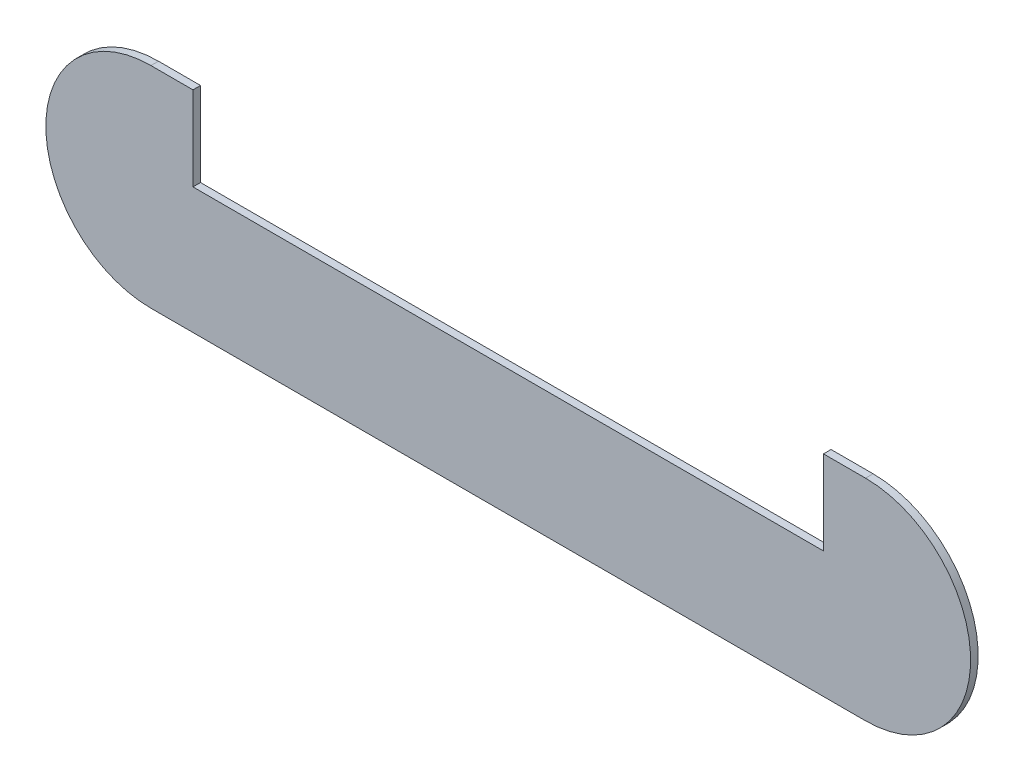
from build123d import *

# Parameters (mm, degrees)
BOSS_EXTRU_1_DEPTH           = 18
ENL_V_MAT_EXTRU_1_DEPTH      = 1129.195018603
ENL_V_MAT_EXTRU_1_DEPTH_BACK = 18


with BuildPart() as part:
    # Esquisse1 → Boss.-Extru.1 (new body)
    with BuildSketch(Plane.XY):
        with BuildLine():
            Line((-850, -250), (850, -250))
            ThreePointArc((850, -250), (1100, 0), (850, 250))
            Line((850, 250), (-850, 250))
            ThreePointArc((-850, 250), (-1100, 0), (-850, -250))
        make_face()
    extrude(amount=BOSS_EXTRU_1_DEPTH)

    # Esquisse2 → Enl_v. mat.-Extru.1 (cut, two sides: drawn at the far end of the back side and taken through both)
    with BuildSketch(Plane.XY.offset(18).offset(-ENL_V_MAT_EXTRU_1_DEPTH_BACK)):
        Polygon((-750, 4092.753579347), (-750, 250), (-750, 50), (750, 50), (750, 250), (750, 4092.753579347), (750, 11778.260738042), (-750, 11778.260738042), align=None)
    extrude(amount=ENL_V_MAT_EXTRU_1_DEPTH + ENL_V_MAT_EXTRU_1_DEPTH_BACK, mode=Mode.SUBTRACT)


solid = part.part
